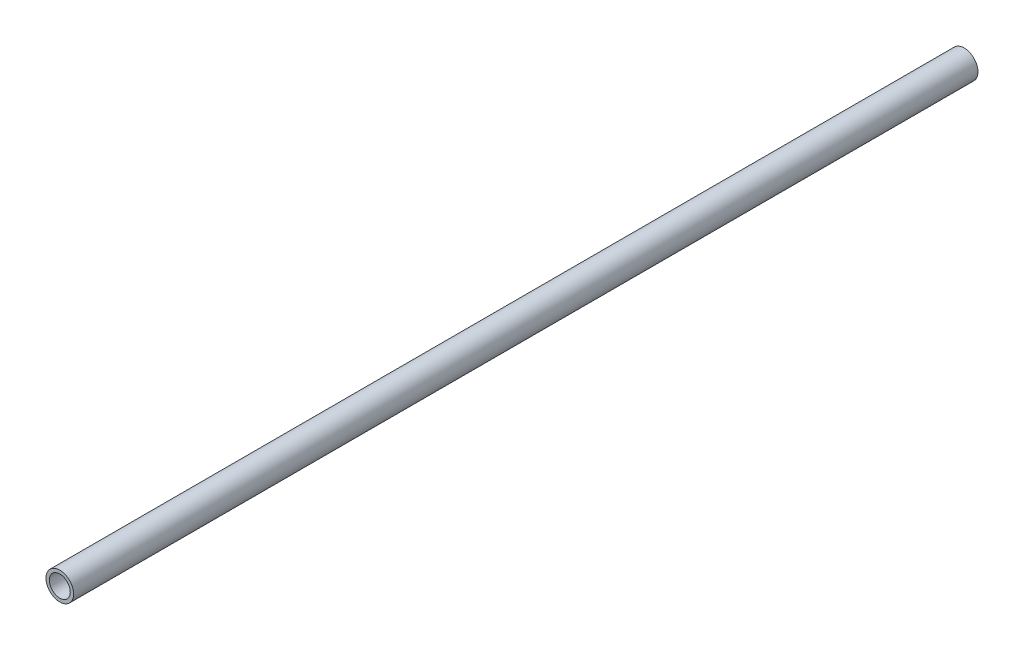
ISO-10303-21;
HEADER;
FILE_DESCRIPTION(('STEP AP214'),'2;1');
FILE_NAME('part.step','',(''),(''),'','','');
FILE_SCHEMA(('AUTOMOTIVE_DESIGN { 1 0 10303 214 1 1 1 1 }'));
ENDSEC;
DATA;
#1=APPLICATION_CONTEXT('core data for automotive mechanical design processes');
#2=APPLICATION_PROTOCOL_DEFINITION('international standard','automotive_design',2000,#1);
#3=PRODUCT_CONTEXT('',#1,'mechanical');
#4=PRODUCT('Part','Part','',(#3));
#5=PRODUCT_RELATED_PRODUCT_CATEGORY('part','',(#4));
#6=PRODUCT_DEFINITION_FORMATION('','',#4);
#7=PRODUCT_DEFINITION_CONTEXT('part definition',#1,'design');
#8=PRODUCT_DEFINITION('design','',#6,#7);
#9=PRODUCT_DEFINITION_SHAPE('','',#8);
#10=(LENGTH_UNIT() NAMED_UNIT(*) SI_UNIT(.MILLI.,.METRE.));
#11=(NAMED_UNIT(*) PLANE_ANGLE_UNIT() SI_UNIT($,.RADIAN.));
#12=(NAMED_UNIT(*) SI_UNIT($,.STERADIAN.) SOLID_ANGLE_UNIT());
#13=UNCERTAINTY_MEASURE_WITH_UNIT(LENGTH_MEASURE(1.E-05),#10,'distance_accuracy_value','');
#14=(GEOMETRIC_REPRESENTATION_CONTEXT(3) GLOBAL_UNCERTAINTY_ASSIGNED_CONTEXT((#13)) GLOBAL_UNIT_ASSIGNED_CONTEXT((#10,
#11,#12)) REPRESENTATION_CONTEXT('',''));
#15=CARTESIAN_POINT('',(0.,0.,0.));
#16=DIRECTION('',(0.,0.,1.));
#17=DIRECTION('',(1.,0.,0.));
#18=AXIS2_PLACEMENT_3D('',#15,#16,#17);
#19=CARTESIAN_POINT('',(0.,0.,108.));
#20=DIRECTION('',(0.,0.,1.));
#21=DIRECTION('',(1.,0.,0.));
#22=AXIS2_PLACEMENT_3D('',#19,#20,#21);
#23=PLANE('',#22);
#24=CARTESIAN_POINT('',(0.,0.,108.));
#25=DIRECTION('',(0.,0.,1.));
#26=DIRECTION('',(1.,0.,0.));
#27=AXIS2_PLACEMENT_3D('',#24,#25,#26);
#28=CIRCLE('',#27,1.65);
#29=CARTESIAN_POINT('',(1.65,0.,108.));
#30=VERTEX_POINT('',#29);
#31=EDGE_CURVE('E10',#30,#30,#28,.T.);
#32=ORIENTED_EDGE('',*,*,#31,.T.);
#33=EDGE_LOOP('',(#32));
#34=FACE_BOUND('',#33,.T.);
#35=CARTESIAN_POINT('',(0.,0.,108.));
#36=DIRECTION('',(0.,0.,1.));
#37=DIRECTION('',(1.,0.,0.));
#38=AXIS2_PLACEMENT_3D('',#35,#36,#37);
#39=CIRCLE('',#38,1.25);
#40=CARTESIAN_POINT('',(1.25,0.,108.));
#41=VERTEX_POINT('',#40);
#42=EDGE_CURVE('E39',#41,#41,#39,.T.);
#43=ORIENTED_EDGE('',*,*,#42,.F.);
#44=EDGE_LOOP('',(#43));
#45=FACE_BOUND('',#44,.T.);
#46=ADVANCED_FACE('F28',(#34,#45),#23,.T.);
#47=CARTESIAN_POINT('',(0.,0.,0.));
#48=DIRECTION('',(0.,0.,1.));
#49=DIRECTION('',(1.,0.,0.));
#50=AXIS2_PLACEMENT_3D('',#47,#48,#49);
#51=PLANE('',#50);
#52=CARTESIAN_POINT('',(0.,0.,0.));
#53=DIRECTION('',(0.,0.,1.));
#54=DIRECTION('',(1.,0.,0.));
#55=AXIS2_PLACEMENT_3D('',#52,#53,#54);
#56=CIRCLE('',#55,1.65);
#57=CARTESIAN_POINT('',(1.65,0.,0.));
#58=VERTEX_POINT('',#57);
#59=EDGE_CURVE('E32',#58,#58,#56,.T.);
#60=ORIENTED_EDGE('',*,*,#59,.F.);
#61=EDGE_LOOP('',(#60));
#62=FACE_BOUND('',#61,.T.);
#63=CARTESIAN_POINT('',(0.,0.,0.));
#64=DIRECTION('',(0.,0.,1.));
#65=DIRECTION('',(1.,0.,0.));
#66=AXIS2_PLACEMENT_3D('',#63,#64,#65);
#67=CIRCLE('',#66,1.25);
#68=CARTESIAN_POINT('',(1.25,0.,0.));
#69=VERTEX_POINT('',#68);
#70=EDGE_CURVE('E41',#69,#69,#67,.T.);
#71=ORIENTED_EDGE('',*,*,#70,.T.);
#72=EDGE_LOOP('',(#71));
#73=FACE_BOUND('',#72,.T.);
#74=ADVANCED_FACE('F51',(#62,#73),#51,.F.);
#75=CARTESIAN_POINT('',(0.,0.,108.));
#76=DIRECTION('',(0.,0.,-1.));
#77=DIRECTION('',(-1.,0.,0.));
#78=AXIS2_PLACEMENT_3D('',#75,#76,#77);
#79=CYLINDRICAL_SURFACE('',#78,1.65);
#80=ORIENTED_EDGE('',*,*,#31,.F.);
#81=EDGE_LOOP('',(#80));
#82=FACE_BOUND('',#81,.T.);
#83=ORIENTED_EDGE('',*,*,#59,.T.);
#84=EDGE_LOOP('',(#83));
#85=FACE_BOUND('',#84,.T.);
#86=ADVANCED_FACE('F30',(#82,#85),#79,.T.);
#87=CARTESIAN_POINT('',(0.,0.,108.));
#88=DIRECTION('',(0.,0.,-1.));
#89=DIRECTION('',(-1.,0.,0.));
#90=AXIS2_PLACEMENT_3D('',#87,#88,#89);
#91=CYLINDRICAL_SURFACE('',#90,1.25);
#92=ORIENTED_EDGE('',*,*,#42,.T.);
#93=EDGE_LOOP('',(#92));
#94=FACE_BOUND('',#93,.T.);
#95=ORIENTED_EDGE('',*,*,#70,.F.);
#96=EDGE_LOOP('',(#95));
#97=FACE_BOUND('',#96,.T.);
#98=ADVANCED_FACE('F47',(#94,#97),#91,.F.);
#99=CLOSED_SHELL('',(#46,#74,#86,#98));
#100=MANIFOLD_SOLID_BREP('B2',#99);
#101=ADVANCED_BREP_SHAPE_REPRESENTATION('',(#18,#100),#14);
#102=SHAPE_DEFINITION_REPRESENTATION(#9,#101);
ENDSEC;
END-ISO-10303-21;
